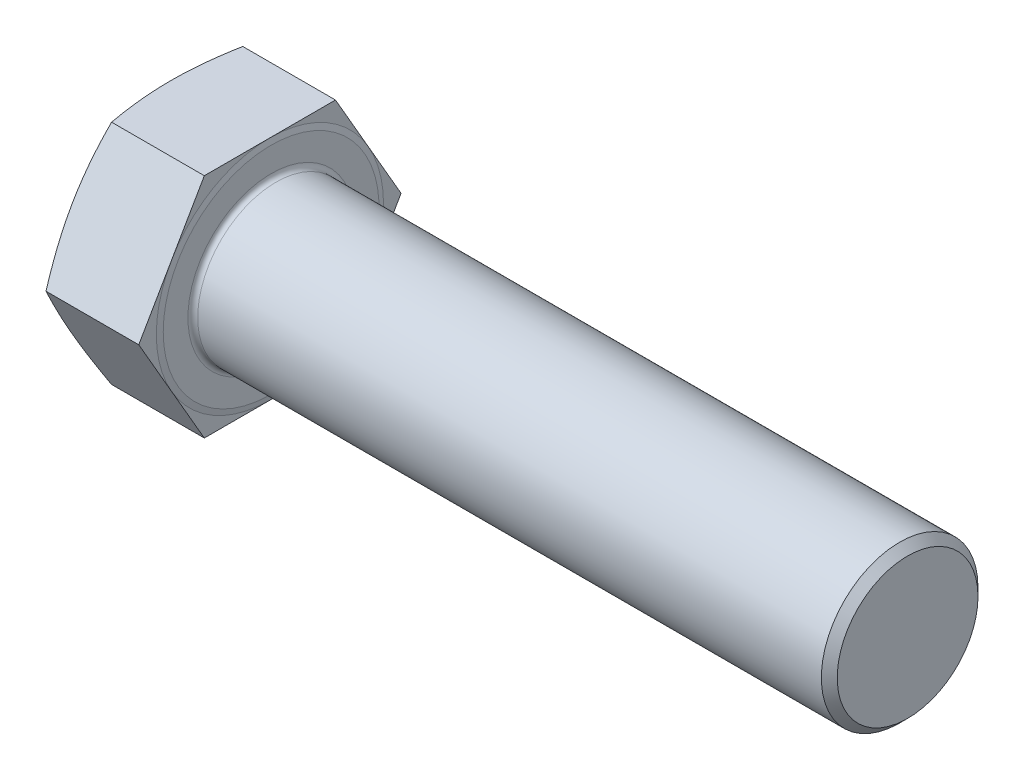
from build123d import *

# Parameters (mm, degrees)
BASEHEAD_DEPTH = 40.5
SKETCH3_R      = 32
BASEBODY_DEPTH = 260
HEADFILLET_R   = 2
CHAMFER1_SIZE  = 3.2475


with BuildPart() as part:
    # Sketch-BaseHead → BaseHead (new body)
    with BuildSketch(Plane(origin=(0, 0, 0), x_dir=(0, 0, -1), z_dir=(1, 0, 0))):
        Polygon((53.578104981, 0), (26.78905249, 46.4), (-26.78905249, 46.4), (-53.578104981, 0), (-26.78905249, -46.4), (26.78905249, -46.4), align=None)
    extrude(amount=BASEHEAD_DEPTH)

    # Sketch4 → HeadChamfer (revolve, cut)
    with BuildSketch(Plane(origin=(-0.264637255, 0, 5.916896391), x_dir=(0, 0, -1), z_dir=(0, 1, 0))):
        Polygon((59.495001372, -0.264637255), (52.316896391, -0.264637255), (59.495001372, -2.877253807), align=None)
    revolve(axis=Axis((-4.001564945, 0, 0), (1, 0, 0)), mode=Mode.SUBTRACT)

    # Sketch1 → Revolve1 (revolve)
    with BuildSketch(Plane.XY, mode=Mode.PRIVATE) as revolve1_sk:
        Polygon((40.5, 0), (41, 0), (41, -44.08), (40.5, -46.4), align=None)
    revolve(revolve1_sk.sketch.rotate(Axis((-4.001564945, 0, 0), (1, 0, 0)), 270), axis=Axis((-4.001564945, 0, 0), (1, 0, 0)))

    # Sketch3 → BaseBody (add)
    with BuildSketch(Plane(origin=(41, 0, 0), x_dir=(0, 0, -1), z_dir=(1, 0, 0))):
        Circle(SKETCH3_R)
    extrude(amount=BASEBODY_DEPTH)

    # HeadFillet
    headfillet_edges = [part.edges().sort_by_distance(p)[0] for p in [
        (41, 0, 32),
    ]]
    fillet(headfillet_edges, radius=HEADFILLET_R)

    # Chamfer1
    chamfer1_edges = [part.edges().sort_by_distance(p)[0] for p in [
        (301, 0, 32),
    ]]
    chamfer(chamfer1_edges, length=CHAMFER1_SIZE)


solid = part.part
